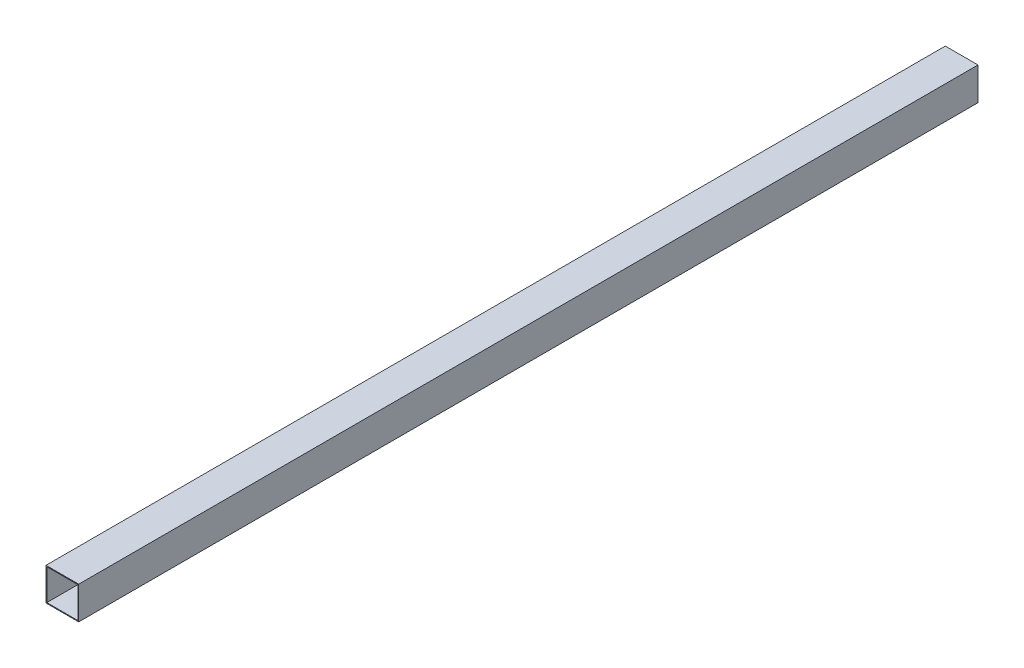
ISO-10303-21;
HEADER;
FILE_DESCRIPTION(('STEP AP214'),'2;1');
FILE_NAME('part.step','',(''),(''),'','','');
FILE_SCHEMA(('AUTOMOTIVE_DESIGN { 1 0 10303 214 1 1 1 1 }'));
ENDSEC;
DATA;
#1=APPLICATION_CONTEXT('core data for automotive mechanical design processes');
#2=APPLICATION_PROTOCOL_DEFINITION('international standard','automotive_design',2000,#1);
#3=PRODUCT_CONTEXT('',#1,'mechanical');
#4=PRODUCT('Part','Part','',(#3));
#5=PRODUCT_RELATED_PRODUCT_CATEGORY('part','',(#4));
#6=PRODUCT_DEFINITION_FORMATION('','',#4);
#7=PRODUCT_DEFINITION_CONTEXT('part definition',#1,'design');
#8=PRODUCT_DEFINITION('design','',#6,#7);
#9=PRODUCT_DEFINITION_SHAPE('','',#8);
#10=(LENGTH_UNIT() NAMED_UNIT(*) SI_UNIT(.MILLI.,.METRE.));
#11=(NAMED_UNIT(*) PLANE_ANGLE_UNIT() SI_UNIT($,.RADIAN.));
#12=(NAMED_UNIT(*) SI_UNIT($,.STERADIAN.) SOLID_ANGLE_UNIT());
#13=UNCERTAINTY_MEASURE_WITH_UNIT(LENGTH_MEASURE(1.E-05),#10,'distance_accuracy_value','');
#14=(GEOMETRIC_REPRESENTATION_CONTEXT(3) GLOBAL_UNCERTAINTY_ASSIGNED_CONTEXT((#13)) GLOBAL_UNIT_ASSIGNED_CONTEXT((#10,
#11,#12)) REPRESENTATION_CONTEXT('',''));
#15=CARTESIAN_POINT('',(0.,0.,0.));
#16=DIRECTION('',(0.,0.,1.));
#17=DIRECTION('',(1.,0.,0.));
#18=AXIS2_PLACEMENT_3D('',#15,#16,#17);
#19=CARTESIAN_POINT('',(0.,0.,1100.));
#20=DIRECTION('',(0.,0.,1.));
#21=DIRECTION('',(1.,0.,0.));
#22=AXIS2_PLACEMENT_3D('',#19,#20,#21);
#23=PLANE('',#22);
#24=DIRECTION('',(0.,1.,0.));
#25=VECTOR('',#24,1.);
#26=CARTESIAN_POINT('',(20.,-20.,1100.));
#27=LINE('',#26,#25);
#28=CARTESIAN_POINT('',(20.,-20.,1100.));
#29=VERTEX_POINT('',#28);
#30=CARTESIAN_POINT('',(20.,20.,1100.));
#31=VERTEX_POINT('',#30);
#32=EDGE_CURVE('E168',#29,#31,#27,.T.);
#33=ORIENTED_EDGE('',*,*,#32,.T.);
#34=DIRECTION('',(-1.,0.,0.));
#35=VECTOR('',#34,1.);
#36=CARTESIAN_POINT('',(-20.,20.,1100.));
#37=LINE('',#36,#35);
#38=CARTESIAN_POINT('',(-20.,20.,1100.));
#39=VERTEX_POINT('',#38);
#40=EDGE_CURVE('E171',#31,#39,#37,.T.);
#41=ORIENTED_EDGE('',*,*,#40,.T.);
#42=DIRECTION('',(0.,-1.,0.));
#43=VECTOR('',#42,1.);
#44=CARTESIAN_POINT('',(-20.,-20.,1100.));
#45=LINE('',#44,#43);
#46=CARTESIAN_POINT('',(-20.,-20.,1100.));
#47=VERTEX_POINT('',#46);
#48=EDGE_CURVE('E174',#39,#47,#45,.T.);
#49=ORIENTED_EDGE('',*,*,#48,.T.);
#50=DIRECTION('',(1.,0.,0.));
#51=VECTOR('',#50,1.);
#52=CARTESIAN_POINT('',(-20.,-20.,1100.));
#53=LINE('',#52,#51);
#54=EDGE_CURVE('E176',#47,#29,#53,.T.);
#55=ORIENTED_EDGE('',*,*,#54,.T.);
#56=EDGE_LOOP('',(#33,#41,#49,#55));
#57=FACE_BOUND('',#56,.T.);
#58=DIRECTION('',(-1.,0.,0.));
#59=VECTOR('',#58,1.);
#60=CARTESIAN_POINT('',(0.,19.,1100.));
#61=LINE('',#60,#59);
#62=CARTESIAN_POINT('',(19.,19.,1100.));
#63=VERTEX_POINT('',#62);
#64=CARTESIAN_POINT('',(-19.,19.,1100.));
#65=VERTEX_POINT('',#64);
#66=EDGE_CURVE('E140',#63,#65,#61,.T.);
#67=ORIENTED_EDGE('',*,*,#66,.F.);
#68=DIRECTION('',(0.,1.,0.));
#69=VECTOR('',#68,1.);
#70=CARTESIAN_POINT('',(19.,0.,1100.));
#71=LINE('',#70,#69);
#72=CARTESIAN_POINT('',(19.,-19.,1100.));
#73=VERTEX_POINT('',#72);
#74=EDGE_CURVE('E132',#73,#63,#71,.T.);
#75=ORIENTED_EDGE('',*,*,#74,.F.);
#76=DIRECTION('',(1.,0.,0.));
#77=VECTOR('',#76,1.);
#78=CARTESIAN_POINT('',(0.,-19.,1100.));
#79=LINE('',#78,#77);
#80=CARTESIAN_POINT('',(-19.,-19.,1100.));
#81=VERTEX_POINT('',#80);
#82=EDGE_CURVE('E154',#81,#73,#79,.T.);
#83=ORIENTED_EDGE('',*,*,#82,.F.);
#84=DIRECTION('',(0.,-1.,0.));
#85=VECTOR('',#84,1.);
#86=CARTESIAN_POINT('',(-19.,0.,1100.));
#87=LINE('',#86,#85);
#88=EDGE_CURVE('E152',#65,#81,#87,.T.);
#89=ORIENTED_EDGE('',*,*,#88,.F.);
#90=EDGE_LOOP('',(#67,#75,#83,#89));
#91=FACE_BOUND('',#90,.T.);
#92=ADVANCED_FACE('F67',(#57,#91),#23,.T.);
#93=CARTESIAN_POINT('',(0.,0.,0.));
#94=DIRECTION('',(0.,0.,1.));
#95=DIRECTION('',(1.,0.,0.));
#96=AXIS2_PLACEMENT_3D('',#93,#94,#95);
#97=PLANE('',#96);
#98=DIRECTION('',(0.,1.,0.));
#99=VECTOR('',#98,1.);
#100=CARTESIAN_POINT('',(20.,-20.,0.));
#101=LINE('',#100,#99);
#102=CARTESIAN_POINT('',(20.,-20.,0.));
#103=VERTEX_POINT('',#102);
#104=CARTESIAN_POINT('',(20.,20.,0.));
#105=VERTEX_POINT('',#104);
#106=EDGE_CURVE('E148',#103,#105,#101,.T.);
#107=ORIENTED_EDGE('',*,*,#106,.F.);
#108=DIRECTION('',(1.,0.,0.));
#109=VECTOR('',#108,1.);
#110=CARTESIAN_POINT('',(-20.,-20.,0.));
#111=LINE('',#110,#109);
#112=CARTESIAN_POINT('',(-20.,-20.,0.));
#113=VERTEX_POINT('',#112);
#114=EDGE_CURVE('E172',#113,#103,#111,.T.);
#115=ORIENTED_EDGE('',*,*,#114,.F.);
#116=DIRECTION('',(0.,-1.,0.));
#117=VECTOR('',#116,1.);
#118=CARTESIAN_POINT('',(-20.,-20.,0.));
#119=LINE('',#118,#117);
#120=CARTESIAN_POINT('',(-20.,20.,0.));
#121=VERTEX_POINT('',#120);
#122=EDGE_CURVE('E183',#121,#113,#119,.T.);
#123=ORIENTED_EDGE('',*,*,#122,.F.);
#124=DIRECTION('',(-1.,0.,0.));
#125=VECTOR('',#124,1.);
#126=CARTESIAN_POINT('',(-20.,20.,0.));
#127=LINE('',#126,#125);
#128=EDGE_CURVE('E181',#105,#121,#127,.T.);
#129=ORIENTED_EDGE('',*,*,#128,.F.);
#130=EDGE_LOOP('',(#107,#115,#123,#129));
#131=FACE_BOUND('',#130,.T.);
#132=DIRECTION('',(0.,1.,0.));
#133=VECTOR('',#132,1.);
#134=CARTESIAN_POINT('',(19.,0.,0.));
#135=LINE('',#134,#133);
#136=CARTESIAN_POINT('',(19.,-19.,0.));
#137=VERTEX_POINT('',#136);
#138=CARTESIAN_POINT('',(19.,19.,0.));
#139=VERTEX_POINT('',#138);
#140=EDGE_CURVE('E90',#137,#139,#135,.T.);
#141=ORIENTED_EDGE('',*,*,#140,.T.);
#142=DIRECTION('',(-1.,0.,0.));
#143=VECTOR('',#142,1.);
#144=CARTESIAN_POINT('',(0.,19.,0.));
#145=LINE('',#144,#143);
#146=CARTESIAN_POINT('',(-19.,19.,0.));
#147=VERTEX_POINT('',#146);
#148=EDGE_CURVE('E147',#139,#147,#145,.T.);
#149=ORIENTED_EDGE('',*,*,#148,.T.);
#150=DIRECTION('',(0.,-1.,0.));
#151=VECTOR('',#150,1.);
#152=CARTESIAN_POINT('',(-19.,0.,0.));
#153=LINE('',#152,#151);
#154=CARTESIAN_POINT('',(-19.,-19.,0.));
#155=VERTEX_POINT('',#154);
#156=EDGE_CURVE('E160',#147,#155,#153,.T.);
#157=ORIENTED_EDGE('',*,*,#156,.T.);
#158=DIRECTION('',(1.,0.,0.));
#159=VECTOR('',#158,1.);
#160=CARTESIAN_POINT('',(0.,-19.,0.));
#161=LINE('',#160,#159);
#162=EDGE_CURVE('E141',#155,#137,#161,.T.);
#163=ORIENTED_EDGE('',*,*,#162,.T.);
#164=EDGE_LOOP('',(#141,#149,#157,#163));
#165=FACE_BOUND('',#164,.T.);
#166=ADVANCED_FACE('F201',(#131,#165),#97,.F.);
#167=CARTESIAN_POINT('',(20.,-20.,1100.));
#168=DIRECTION('',(-1.,0.,0.));
#169=DIRECTION('',(0.,0.,1.));
#170=AXIS2_PLACEMENT_3D('',#167,#168,#169);
#171=PLANE('',#170);
#172=ORIENTED_EDGE('',*,*,#106,.T.);
#173=DIRECTION('',(0.,0.,-1.));
#174=VECTOR('',#173,1.);
#175=CARTESIAN_POINT('',(20.,20.,1100.));
#176=LINE('',#175,#174);
#177=EDGE_CURVE('E12',#31,#105,#176,.T.);
#178=ORIENTED_EDGE('',*,*,#177,.F.);
#179=ORIENTED_EDGE('',*,*,#32,.F.);
#180=DIRECTION('',(0.,0.,-1.));
#181=VECTOR('',#180,1.);
#182=CARTESIAN_POINT('',(20.,-20.,1100.));
#183=LINE('',#182,#181);
#184=EDGE_CURVE('E178',#29,#103,#183,.T.);
#185=ORIENTED_EDGE('',*,*,#184,.T.);
#186=EDGE_LOOP('',(#172,#178,#179,#185));
#187=FACE_BOUND('',#186,.T.);
#188=ADVANCED_FACE('F69',(#187),#171,.F.);
#189=CARTESIAN_POINT('',(-20.,20.,1100.));
#190=DIRECTION('',(0.,-1.,0.));
#191=DIRECTION('',(0.,0.,-1.));
#192=AXIS2_PLACEMENT_3D('',#189,#190,#191);
#193=PLANE('',#192);
#194=ORIENTED_EDGE('',*,*,#128,.T.);
#195=DIRECTION('',(0.,0.,-1.));
#196=VECTOR('',#195,1.);
#197=CARTESIAN_POINT('',(-20.,20.,1100.));
#198=LINE('',#197,#196);
#199=EDGE_CURVE('E75',#39,#121,#198,.T.);
#200=ORIENTED_EDGE('',*,*,#199,.F.);
#201=ORIENTED_EDGE('',*,*,#40,.F.);
#202=ORIENTED_EDGE('',*,*,#177,.T.);
#203=EDGE_LOOP('',(#194,#200,#201,#202));
#204=FACE_BOUND('',#203,.T.);
#205=ADVANCED_FACE('F211',(#204),#193,.F.);
#206=CARTESIAN_POINT('',(-20.,-20.,1100.));
#207=DIRECTION('',(1.,0.,0.));
#208=DIRECTION('',(0.,0.,-1.));
#209=AXIS2_PLACEMENT_3D('',#206,#207,#208);
#210=PLANE('',#209);
#211=ORIENTED_EDGE('',*,*,#122,.T.);
#212=DIRECTION('',(0.,0.,-1.));
#213=VECTOR('',#212,1.);
#214=CARTESIAN_POINT('',(-20.,-20.,1100.));
#215=LINE('',#214,#213);
#216=EDGE_CURVE('E188',#47,#113,#215,.T.);
#217=ORIENTED_EDGE('',*,*,#216,.F.);
#218=ORIENTED_EDGE('',*,*,#48,.F.);
#219=ORIENTED_EDGE('',*,*,#199,.T.);
#220=EDGE_LOOP('',(#211,#217,#218,#219));
#221=FACE_BOUND('',#220,.T.);
#222=ADVANCED_FACE('F195',(#221),#210,.F.);
#223=CARTESIAN_POINT('',(-20.,-20.,1100.));
#224=DIRECTION('',(0.,1.,0.));
#225=DIRECTION('',(0.,0.,1.));
#226=AXIS2_PLACEMENT_3D('',#223,#224,#225);
#227=PLANE('',#226);
#228=ORIENTED_EDGE('',*,*,#114,.T.);
#229=ORIENTED_EDGE('',*,*,#184,.F.);
#230=ORIENTED_EDGE('',*,*,#54,.F.);
#231=ORIENTED_EDGE('',*,*,#216,.T.);
#232=EDGE_LOOP('',(#228,#229,#230,#231));
#233=FACE_BOUND('',#232,.T.);
#234=ADVANCED_FACE('F205',(#233),#227,.F.);
#235=CARTESIAN_POINT('',(19.,0.,1100.));
#236=DIRECTION('',(-1.,0.,0.));
#237=DIRECTION('',(0.,0.,1.));
#238=AXIS2_PLACEMENT_3D('',#235,#236,#237);
#239=PLANE('',#238);
#240=ORIENTED_EDGE('',*,*,#140,.F.);
#241=DIRECTION('',(0.,0.,-1.));
#242=VECTOR('',#241,1.);
#243=CARTESIAN_POINT('',(19.,-19.,1100.));
#244=LINE('',#243,#242);
#245=EDGE_CURVE('E136',#73,#137,#244,.T.);
#246=ORIENTED_EDGE('',*,*,#245,.F.);
#247=ORIENTED_EDGE('',*,*,#74,.T.);
#248=DIRECTION('',(0.,0.,-1.));
#249=VECTOR('',#248,1.);
#250=CARTESIAN_POINT('',(19.,19.,1100.));
#251=LINE('',#250,#249);
#252=EDGE_CURVE('E135',#63,#139,#251,.T.);
#253=ORIENTED_EDGE('',*,*,#252,.T.);
#254=EDGE_LOOP('',(#240,#246,#247,#253));
#255=FACE_BOUND('',#254,.T.);
#256=ADVANCED_FACE('F134',(#255),#239,.T.);
#257=CARTESIAN_POINT('',(0.,19.,1100.));
#258=DIRECTION('',(0.,-1.,0.));
#259=DIRECTION('',(0.,0.,-1.));
#260=AXIS2_PLACEMENT_3D('',#257,#258,#259);
#261=PLANE('',#260);
#262=ORIENTED_EDGE('',*,*,#148,.F.);
#263=ORIENTED_EDGE('',*,*,#252,.F.);
#264=ORIENTED_EDGE('',*,*,#66,.T.);
#265=DIRECTION('',(0.,0.,-1.));
#266=VECTOR('',#265,1.);
#267=CARTESIAN_POINT('',(-19.,19.,1100.));
#268=LINE('',#267,#266);
#269=EDGE_CURVE('E149',#65,#147,#268,.T.);
#270=ORIENTED_EDGE('',*,*,#269,.T.);
#271=EDGE_LOOP('',(#262,#263,#264,#270));
#272=FACE_BOUND('',#271,.T.);
#273=ADVANCED_FACE('F144',(#272),#261,.T.);
#274=CARTESIAN_POINT('',(-19.,0.,1100.));
#275=DIRECTION('',(1.,0.,0.));
#276=DIRECTION('',(0.,0.,-1.));
#277=AXIS2_PLACEMENT_3D('',#274,#275,#276);
#278=PLANE('',#277);
#279=ORIENTED_EDGE('',*,*,#156,.F.);
#280=ORIENTED_EDGE('',*,*,#269,.F.);
#281=ORIENTED_EDGE('',*,*,#88,.T.);
#282=DIRECTION('',(0.,0.,-1.));
#283=VECTOR('',#282,1.);
#284=CARTESIAN_POINT('',(-19.,-19.,1100.));
#285=LINE('',#284,#283);
#286=EDGE_CURVE('E82',#81,#155,#285,.T.);
#287=ORIENTED_EDGE('',*,*,#286,.T.);
#288=EDGE_LOOP('',(#279,#280,#281,#287));
#289=FACE_BOUND('',#288,.T.);
#290=ADVANCED_FACE('F234',(#289),#278,.T.);
#291=CARTESIAN_POINT('',(0.,-19.,1100.));
#292=DIRECTION('',(0.,1.,0.));
#293=DIRECTION('',(0.,0.,1.));
#294=AXIS2_PLACEMENT_3D('',#291,#292,#293);
#295=PLANE('',#294);
#296=ORIENTED_EDGE('',*,*,#162,.F.);
#297=ORIENTED_EDGE('',*,*,#286,.F.);
#298=ORIENTED_EDGE('',*,*,#82,.T.);
#299=ORIENTED_EDGE('',*,*,#245,.T.);
#300=EDGE_LOOP('',(#296,#297,#298,#299));
#301=FACE_BOUND('',#300,.T.);
#302=ADVANCED_FACE('F238',(#301),#295,.T.);
#303=CLOSED_SHELL('',(#92,#166,#188,#205,#222,#234,#256,#273,#290,#302));
#304=MANIFOLD_SOLID_BREP('B2',#303);
#305=ADVANCED_BREP_SHAPE_REPRESENTATION('',(#18,#304),#14);
#306=SHAPE_DEFINITION_REPRESENTATION(#9,#305);
ENDSEC;
END-ISO-10303-21;
